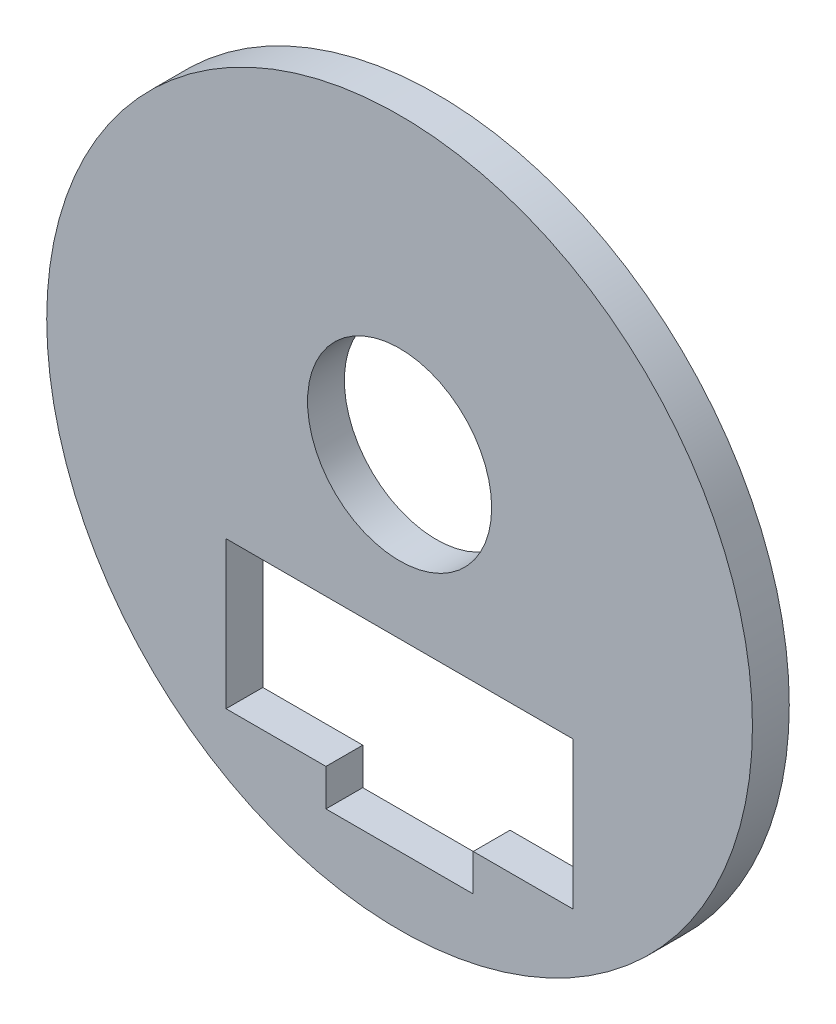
ISO-10303-21;
HEADER;
FILE_DESCRIPTION(('STEP AP214'),'2;1');
FILE_NAME('part.step','',(''),(''),'','','');
FILE_SCHEMA(('AUTOMOTIVE_DESIGN { 1 0 10303 214 1 1 1 1 }'));
ENDSEC;
DATA;
#1=APPLICATION_CONTEXT('core data for automotive mechanical design processes');
#2=APPLICATION_PROTOCOL_DEFINITION('international standard','automotive_design',2000,#1);
#3=PRODUCT_CONTEXT('',#1,'mechanical');
#4=PRODUCT('Part','Part','',(#3));
#5=PRODUCT_RELATED_PRODUCT_CATEGORY('part','',(#4));
#6=PRODUCT_DEFINITION_FORMATION('','',#4);
#7=PRODUCT_DEFINITION_CONTEXT('part definition',#1,'design');
#8=PRODUCT_DEFINITION('design','',#6,#7);
#9=PRODUCT_DEFINITION_SHAPE('','',#8);
#10=(LENGTH_UNIT() NAMED_UNIT(*) SI_UNIT(.MILLI.,.METRE.));
#11=(NAMED_UNIT(*) PLANE_ANGLE_UNIT() SI_UNIT($,.RADIAN.));
#12=(NAMED_UNIT(*) SI_UNIT($,.STERADIAN.) SOLID_ANGLE_UNIT());
#13=UNCERTAINTY_MEASURE_WITH_UNIT(LENGTH_MEASURE(1.E-05),#10,'distance_accuracy_value','');
#14=(GEOMETRIC_REPRESENTATION_CONTEXT(3) GLOBAL_UNCERTAINTY_ASSIGNED_CONTEXT((#13)) GLOBAL_UNIT_ASSIGNED_CONTEXT((#10,
#11,#12)) REPRESENTATION_CONTEXT('',''));
#15=CARTESIAN_POINT('',(0.,0.,0.));
#16=DIRECTION('',(0.,0.,1.));
#17=DIRECTION('',(1.,0.,0.));
#18=AXIS2_PLACEMENT_3D('',#15,#16,#17);
#19=CARTESIAN_POINT('',(-17.9578,-25.654,-3.81));
#20=DIRECTION('',(0.,-1.,0.));
#21=DIRECTION('',(0.,0.,-1.));
#22=AXIS2_PLACEMENT_3D('',#19,#20,#21);
#23=PLANE('',#22);
#24=DIRECTION('',(1.,0.,0.));
#25=VECTOR('',#24,1.);
#26=CARTESIAN_POINT('',(-17.9578,-25.654,0.));
#27=LINE('',#26,#25);
#28=CARTESIAN_POINT('',(-17.9578,-25.654,0.));
#29=VERTEX_POINT('',#28);
#30=CARTESIAN_POINT('',(-7.62,-25.654,0.));
#31=VERTEX_POINT('',#30);
#32=EDGE_CURVE('E116',#29,#31,#27,.T.);
#33=ORIENTED_EDGE('',*,*,#32,.T.);
#34=DIRECTION('',(0.,0.,-1.));
#35=VECTOR('',#34,1.);
#36=CARTESIAN_POINT('',(-7.62,-25.654,0.));
#37=LINE('',#36,#35);
#38=CARTESIAN_POINT('',(-7.62,-25.654,-3.81));
#39=VERTEX_POINT('',#38);
#40=EDGE_CURVE('E101',#31,#39,#37,.T.);
#41=ORIENTED_EDGE('',*,*,#40,.T.);
#42=DIRECTION('',(1.,0.,0.));
#43=VECTOR('',#42,1.);
#44=CARTESIAN_POINT('',(-17.9578,-25.654,-3.81));
#45=LINE('',#44,#43);
#46=CARTESIAN_POINT('',(-17.9578,-25.654,-3.81));
#47=VERTEX_POINT('',#46);
#48=EDGE_CURVE('E113',#47,#39,#45,.T.);
#49=ORIENTED_EDGE('',*,*,#48,.F.);
#50=DIRECTION('',(0.,0.,1.));
#51=VECTOR('',#50,1.);
#52=CARTESIAN_POINT('',(-17.9578,-25.654,-3.81));
#53=LINE('',#52,#51);
#54=EDGE_CURVE('E133',#47,#29,#53,.T.);
#55=ORIENTED_EDGE('',*,*,#54,.T.);
#56=EDGE_LOOP('',(#33,#41,#49,#55));
#57=FACE_BOUND('',#56,.T.);
#58=ADVANCED_FACE('F31',(#57),#23,.F.);
#59=CARTESIAN_POINT('',(0.,0.,-3.81));
#60=DIRECTION('',(0.,0.,1.));
#61=DIRECTION('',(1.,0.,0.));
#62=AXIS2_PLACEMENT_3D('',#59,#60,#61);
#63=CYLINDRICAL_SURFACE('',#62,36.5125);
#64=CARTESIAN_POINT('',(0.,0.,-3.81));
#65=DIRECTION('',(0.,0.,1.));
#66=DIRECTION('',(1.,0.,0.));
#67=AXIS2_PLACEMENT_3D('',#64,#65,#66);
#68=CIRCLE('',#67,36.5125);
#69=CARTESIAN_POINT('',(36.5125,0.,-3.81));
#70=VERTEX_POINT('',#69);
#71=EDGE_CURVE('E11',#70,#70,#68,.T.);
#72=CARTESIAN_POINT('',(0.,0.,0.));
#73=DIRECTION('',(0.,0.,1.));
#74=DIRECTION('',(1.,0.,0.));
#75=AXIS2_PLACEMENT_3D('',#72,#73,#74);
#76=CIRCLE('',#75,36.5125);
#77=CARTESIAN_POINT('',(36.5125,0.,0.));
#78=VERTEX_POINT('',#77);
#79=EDGE_CURVE('E39',#78,#78,#76,.T.);
#80=CARTESIAN_POINT('',(36.5125,0.,-3.81));
#81=CARTESIAN_POINT('',(36.5125,0.,-3.7703125));
#82=CARTESIAN_POINT('',(36.5125,0.,-3.730625));
#83=CARTESIAN_POINT('',(36.5125,0.,-3.65125));
#84=CARTESIAN_POINT('',(36.5125,0.,-3.6115625));
#85=CARTESIAN_POINT('',(36.5125,0.,-3.5321875));
#86=CARTESIAN_POINT('',(36.5125,0.,-3.4925));
#87=CARTESIAN_POINT('',(36.5125,0.,-3.413125));
#88=CARTESIAN_POINT('',(36.5125,0.,-3.3734375));
#89=CARTESIAN_POINT('',(36.5125,0.,-3.2940625));
#90=CARTESIAN_POINT('',(36.5125,0.,-3.254375));
#91=CARTESIAN_POINT('',(36.5125,0.,-3.175));
#92=CARTESIAN_POINT('',(36.5125,0.,-3.1353125));
#93=CARTESIAN_POINT('',(36.5125,0.,-3.0559375));
#94=CARTESIAN_POINT('',(36.5125,0.,-3.01625));
#95=CARTESIAN_POINT('',(36.5125,0.,-2.936875));
#96=CARTESIAN_POINT('',(36.5125,0.,-2.8971875));
#97=CARTESIAN_POINT('',(36.5125,0.,-2.8178125));
#98=CARTESIAN_POINT('',(36.5125,0.,-2.778125));
#99=CARTESIAN_POINT('',(36.5125,0.,-2.69875));
#100=CARTESIAN_POINT('',(36.5125,0.,-2.6590625));
#101=CARTESIAN_POINT('',(36.5125,0.,-2.5796875));
#102=CARTESIAN_POINT('',(36.5125,0.,-2.54));
#103=CARTESIAN_POINT('',(36.5125,0.,-2.460625));
#104=CARTESIAN_POINT('',(36.5125,0.,-2.4209375));
#105=CARTESIAN_POINT('',(36.5125,0.,-2.3415625));
#106=CARTESIAN_POINT('',(36.5125,0.,-2.301875));
#107=CARTESIAN_POINT('',(36.5125,0.,-2.2225));
#108=CARTESIAN_POINT('',(36.5125,0.,-2.1828125));
#109=CARTESIAN_POINT('',(36.5125,0.,-2.1034375));
#110=CARTESIAN_POINT('',(36.5125,0.,-2.06375));
#111=CARTESIAN_POINT('',(36.5125,0.,-1.984375));
#112=CARTESIAN_POINT('',(36.5125,0.,-1.9446875));
#113=CARTESIAN_POINT('',(36.5125,0.,-1.8653125));
#114=CARTESIAN_POINT('',(36.5125,0.,-1.825625));
#115=CARTESIAN_POINT('',(36.5125,0.,-1.74625));
#116=CARTESIAN_POINT('',(36.5125,0.,-1.7065625));
#117=CARTESIAN_POINT('',(36.5125,0.,-1.6271875));
#118=CARTESIAN_POINT('',(36.5125,0.,-1.5875));
#119=CARTESIAN_POINT('',(36.5125,0.,-1.508125));
#120=CARTESIAN_POINT('',(36.5125,0.,-1.4684375));
#121=CARTESIAN_POINT('',(36.5125,0.,-1.3890625));
#122=CARTESIAN_POINT('',(36.5125,0.,-1.349375));
#123=CARTESIAN_POINT('',(36.5125,0.,-1.27));
#124=CARTESIAN_POINT('',(36.5125,0.,-1.2303125));
#125=CARTESIAN_POINT('',(36.5125,0.,-1.1509375));
#126=CARTESIAN_POINT('',(36.5125,0.,-1.11125));
#127=CARTESIAN_POINT('',(36.5125,0.,-1.031875));
#128=CARTESIAN_POINT('',(36.5125,0.,-0.9921875));
#129=CARTESIAN_POINT('',(36.5125,0.,-0.9128125));
#130=CARTESIAN_POINT('',(36.5125,0.,-0.873125));
#131=CARTESIAN_POINT('',(36.5125,0.,-0.79375));
#132=CARTESIAN_POINT('',(36.5125,0.,-0.7540625));
#133=CARTESIAN_POINT('',(36.5125,0.,-0.6746875));
#134=CARTESIAN_POINT('',(36.5125,0.,-0.635));
#135=CARTESIAN_POINT('',(36.5125,0.,-0.555625));
#136=CARTESIAN_POINT('',(36.5125,0.,-0.5159375));
#137=CARTESIAN_POINT('',(36.5125,0.,-0.4365625));
#138=CARTESIAN_POINT('',(36.5125,0.,-0.396875));
#139=CARTESIAN_POINT('',(36.5125,0.,-0.3175));
#140=CARTESIAN_POINT('',(36.5125,0.,-0.2778125));
#141=CARTESIAN_POINT('',(36.5125,0.,-0.1984375));
#142=CARTESIAN_POINT('',(36.5125,0.,-0.15875));
#143=CARTESIAN_POINT('',(36.5125,0.,-0.0793749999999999));
#144=CARTESIAN_POINT('',(36.5125,0.,-0.0396874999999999));
#145=CARTESIAN_POINT('',(36.5125,0.,0.));
#146=B_SPLINE_CURVE_WITH_KNOTS('',3,(#80,#81,#82,#83,#84,#85,#86,#87,#88,#89,#90,#91,#92,#93,
#94,#95,#96,#97,#98,#99,#100,#101,#102,#103,#104,#105,#106,#107,#108,#109,#110,#111,#112,#113,
#114,#115,#116,#117,#118,#119,#120,#121,#122,#123,#124,#125,#126,#127,#128,#129,#130,#131,#132,
#133,#134,#135,#136,#137,#138,#139,#140,#141,#142,#143,#144,#145),.UNSPECIFIED.,.F.,.F.,(4,2,2,
2,2,2,2,2,2,2,2,2,2,2,2,2,2,2,2,2,2,2,2,2,2,2,2,2,2,2,2,2,4),(0.,0.1190625,0.238125,0.3571875,
0.47625,0.5953125,0.714375,0.8334375,0.9525,1.0715625,1.190625,1.3096875,1.42875,1.5478125,
1.666875,1.7859375,1.905,2.0240625,2.143125,2.2621875,2.38125,2.5003125,2.619375,2.7384375,
2.8575,2.9765625,3.095625,3.2146875,3.33375,3.4528125,3.571875,3.6909375,3.81),.UNSPECIFIED.);
#147=EDGE_CURVE('BSEAM33',#70,#78,#146,.T.);
#148=ORIENTED_EDGE('',*,*,#71,.T.);
#149=ORIENTED_EDGE('',*,*,#79,.F.);
#150=ORIENTED_EDGE('',*,*,#147,.T.);
#151=ORIENTED_EDGE('',*,*,#147,.F.);
#152=EDGE_LOOP('',(#148,#150,#149,#151));
#153=FACE_BOUND('',#152,.T.);
#154=ADVANCED_FACE('F33',(#153),#63,.T.);
#155=CARTESIAN_POINT('',(0.,0.,-3.81));
#156=DIRECTION('',(0.,0.,1.));
#157=DIRECTION('',(1.,0.,0.));
#158=AXIS2_PLACEMENT_3D('',#155,#156,#157);
#159=PLANE('',#158);
#160=ORIENTED_EDGE('',*,*,#48,.T.);
#161=DIRECTION('',(0.,1.,0.));
#162=VECTOR('',#161,1.);
#163=CARTESIAN_POINT('',(-7.62,-29.464,-3.81));
#164=LINE('',#163,#162);
#165=CARTESIAN_POINT('',(-7.62,-29.464,-3.81));
#166=VERTEX_POINT('',#165);
#167=EDGE_CURVE('E97',#166,#39,#164,.T.);
#168=ORIENTED_EDGE('',*,*,#167,.F.);
#169=DIRECTION('',(-1.,0.,0.));
#170=VECTOR('',#169,1.);
#171=CARTESIAN_POINT('',(-7.62,-29.464,-3.81));
#172=LINE('',#171,#170);
#173=CARTESIAN_POINT('',(7.62,-29.464,-3.81));
#174=VERTEX_POINT('',#173);
#175=EDGE_CURVE('E203',#174,#166,#172,.T.);
#176=ORIENTED_EDGE('',*,*,#175,.F.);
#177=DIRECTION('',(0.,-1.,0.));
#178=VECTOR('',#177,1.);
#179=CARTESIAN_POINT('',(7.62,-29.464,-3.81));
#180=LINE('',#179,#178);
#181=CARTESIAN_POINT('',(7.62,-25.654,-3.81));
#182=VERTEX_POINT('',#181);
#183=EDGE_CURVE('E107',#182,#174,#180,.T.);
#184=ORIENTED_EDGE('',*,*,#183,.F.);
#185=CARTESIAN_POINT('',(17.9578,-25.654,-3.81));
#186=VERTEX_POINT('',#185);
#187=EDGE_CURVE('E54',#182,#186,#45,.T.);
#188=ORIENTED_EDGE('',*,*,#187,.T.);
#189=DIRECTION('',(0.,1.,0.));
#190=VECTOR('',#189,1.);
#191=CARTESIAN_POINT('',(17.9578,-25.654,-3.81));
#192=LINE('',#191,#190);
#193=CARTESIAN_POINT('',(17.9578,-10.414,-3.81));
#194=VERTEX_POINT('',#193);
#195=EDGE_CURVE('E125',#186,#194,#192,.T.);
#196=ORIENTED_EDGE('',*,*,#195,.T.);
#197=DIRECTION('',(-1.,0.,0.));
#198=VECTOR('',#197,1.);
#199=CARTESIAN_POINT('',(-17.9578,-10.414,-3.81));
#200=LINE('',#199,#198);
#201=CARTESIAN_POINT('',(-17.9578,-10.414,-3.81));
#202=VERTEX_POINT('',#201);
#203=EDGE_CURVE('E127',#194,#202,#200,.T.);
#204=ORIENTED_EDGE('',*,*,#203,.T.);
#205=DIRECTION('',(0.,-1.,0.));
#206=VECTOR('',#205,1.);
#207=CARTESIAN_POINT('',(-17.9578,-10.414,-3.81));
#208=LINE('',#207,#206);
#209=EDGE_CURVE('E124',#202,#47,#208,.T.);
#210=ORIENTED_EDGE('',*,*,#209,.T.);
#211=EDGE_LOOP('',(#160,#168,#176,#184,#188,#196,#204,#210));
#212=FACE_BOUND('',#211,.T.);
#213=CARTESIAN_POINT('',(0.,6.096,-3.81));
#214=DIRECTION('',(0.,0.,1.));
#215=DIRECTION('',(1.,0.,0.));
#216=AXIS2_PLACEMENT_3D('',#213,#214,#215);
#217=CIRCLE('',#216,9.525);
#218=CARTESIAN_POINT('',(9.525,6.096,-3.81));
#219=VERTEX_POINT('',#218);
#220=EDGE_CURVE('E145',#219,#219,#217,.T.);
#221=ORIENTED_EDGE('',*,*,#220,.T.);
#222=EDGE_LOOP('',(#221));
#223=FACE_BOUND('',#222,.T.);
#224=ORIENTED_EDGE('',*,*,#71,.F.);
#225=EDGE_LOOP('',(#224));
#226=FACE_BOUND('',#225,.T.);
#227=ADVANCED_FACE('F120',(#212,#223,#226),#159,.F.);
#228=CARTESIAN_POINT('',(0.,0.,0.));
#229=DIRECTION('',(0.,0.,1.));
#230=DIRECTION('',(1.,0.,0.));
#231=AXIS2_PLACEMENT_3D('',#228,#229,#230);
#232=PLANE('',#231);
#233=DIRECTION('',(0.,1.,0.));
#234=VECTOR('',#233,1.);
#235=CARTESIAN_POINT('',(-7.62,-29.464,0.));
#236=LINE('',#235,#234);
#237=CARTESIAN_POINT('',(-7.62,-29.464,0.));
#238=VERTEX_POINT('',#237);
#239=EDGE_CURVE('E201',#238,#31,#236,.T.);
#240=ORIENTED_EDGE('',*,*,#239,.T.);
#241=ORIENTED_EDGE('',*,*,#32,.F.);
#242=DIRECTION('',(0.,-1.,0.));
#243=VECTOR('',#242,1.);
#244=CARTESIAN_POINT('',(-17.9578,-10.414,0.));
#245=LINE('',#244,#243);
#246=CARTESIAN_POINT('',(-17.9578,-10.414,0.));
#247=VERTEX_POINT('',#246);
#248=EDGE_CURVE('E192',#247,#29,#245,.T.);
#249=ORIENTED_EDGE('',*,*,#248,.F.);
#250=DIRECTION('',(-1.,0.,0.));
#251=VECTOR('',#250,1.);
#252=CARTESIAN_POINT('',(-17.9578,-10.414,0.));
#253=LINE('',#252,#251);
#254=CARTESIAN_POINT('',(17.9578,-10.414,0.));
#255=VERTEX_POINT('',#254);
#256=EDGE_CURVE('E188',#255,#247,#253,.T.);
#257=ORIENTED_EDGE('',*,*,#256,.F.);
#258=DIRECTION('',(0.,1.,0.));
#259=VECTOR('',#258,1.);
#260=CARTESIAN_POINT('',(17.9578,-25.654,0.));
#261=LINE('',#260,#259);
#262=CARTESIAN_POINT('',(17.9578,-25.654,0.));
#263=VERTEX_POINT('',#262);
#264=EDGE_CURVE('E182',#263,#255,#261,.T.);
#265=ORIENTED_EDGE('',*,*,#264,.F.);
#266=CARTESIAN_POINT('',(7.61999999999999,-25.654,0.));
#267=VERTEX_POINT('',#266);
#268=EDGE_CURVE('E179',#267,#263,#27,.T.);
#269=ORIENTED_EDGE('',*,*,#268,.F.);
#270=DIRECTION('',(0.,-1.,0.));
#271=VECTOR('',#270,1.);
#272=CARTESIAN_POINT('',(7.62,-29.464,0.));
#273=LINE('',#272,#271);
#274=CARTESIAN_POINT('',(7.62,-29.464,0.));
#275=VERTEX_POINT('',#274);
#276=EDGE_CURVE('E46',#267,#275,#273,.T.);
#277=ORIENTED_EDGE('',*,*,#276,.T.);
#278=DIRECTION('',(-1.,0.,0.));
#279=VECTOR('',#278,1.);
#280=CARTESIAN_POINT('',(-7.62,-29.464,0.));
#281=LINE('',#280,#279);
#282=EDGE_CURVE('E118',#275,#238,#281,.T.);
#283=ORIENTED_EDGE('',*,*,#282,.T.);
#284=EDGE_LOOP('',(#240,#241,#249,#257,#265,#269,#277,#283));
#285=FACE_BOUND('',#284,.T.);
#286=CARTESIAN_POINT('',(0.,6.096,0.));
#287=DIRECTION('',(0.,0.,1.));
#288=DIRECTION('',(1.,0.,0.));
#289=AXIS2_PLACEMENT_3D('',#286,#287,#288);
#290=CIRCLE('',#289,9.525);
#291=CARTESIAN_POINT('',(9.525,6.096,0.));
#292=VERTEX_POINT('',#291);
#293=EDGE_CURVE('E136',#292,#292,#290,.T.);
#294=ORIENTED_EDGE('',*,*,#293,.F.);
#295=EDGE_LOOP('',(#294));
#296=FACE_BOUND('',#295,.T.);
#297=ORIENTED_EDGE('',*,*,#79,.T.);
#298=EDGE_LOOP('',(#297));
#299=FACE_BOUND('',#298,.T.);
#300=ADVANCED_FACE('F150',(#285,#296,#299),#232,.T.);
#301=CARTESIAN_POINT('',(0.,6.096,-3.81));
#302=DIRECTION('',(0.,0.,1.));
#303=DIRECTION('',(1.,0.,0.));
#304=AXIS2_PLACEMENT_3D('',#301,#302,#303);
#305=CYLINDRICAL_SURFACE('',#304,9.525);
#306=CARTESIAN_POINT('',(9.525,6.096,-3.81));
#307=CARTESIAN_POINT('',(9.525,6.096,-3.7703125));
#308=CARTESIAN_POINT('',(9.525,6.096,-3.730625));
#309=CARTESIAN_POINT('',(9.525,6.096,-3.65125));
#310=CARTESIAN_POINT('',(9.525,6.096,-3.6115625));
#311=CARTESIAN_POINT('',(9.525,6.096,-3.5321875));
#312=CARTESIAN_POINT('',(9.525,6.096,-3.4925));
#313=CARTESIAN_POINT('',(9.525,6.096,-3.413125));
#314=CARTESIAN_POINT('',(9.525,6.096,-3.3734375));
#315=CARTESIAN_POINT('',(9.525,6.096,-3.2940625));
#316=CARTESIAN_POINT('',(9.525,6.096,-3.254375));
#317=CARTESIAN_POINT('',(9.525,6.096,-3.175));
#318=CARTESIAN_POINT('',(9.525,6.096,-3.1353125));
#319=CARTESIAN_POINT('',(9.525,6.096,-3.0559375));
#320=CARTESIAN_POINT('',(9.525,6.096,-3.01625));
#321=CARTESIAN_POINT('',(9.525,6.096,-2.936875));
#322=CARTESIAN_POINT('',(9.525,6.096,-2.8971875));
#323=CARTESIAN_POINT('',(9.525,6.096,-2.8178125));
#324=CARTESIAN_POINT('',(9.525,6.096,-2.778125));
#325=CARTESIAN_POINT('',(9.525,6.096,-2.69875));
#326=CARTESIAN_POINT('',(9.525,6.096,-2.6590625));
#327=CARTESIAN_POINT('',(9.525,6.096,-2.5796875));
#328=CARTESIAN_POINT('',(9.525,6.096,-2.54));
#329=CARTESIAN_POINT('',(9.525,6.096,-2.460625));
#330=CARTESIAN_POINT('',(9.525,6.096,-2.4209375));
#331=CARTESIAN_POINT('',(9.525,6.096,-2.3415625));
#332=CARTESIAN_POINT('',(9.525,6.096,-2.301875));
#333=CARTESIAN_POINT('',(9.525,6.096,-2.2225));
#334=CARTESIAN_POINT('',(9.525,6.096,-2.1828125));
#335=CARTESIAN_POINT('',(9.525,6.096,-2.1034375));
#336=CARTESIAN_POINT('',(9.525,6.096,-2.06375));
#337=CARTESIAN_POINT('',(9.525,6.096,-1.984375));
#338=CARTESIAN_POINT('',(9.525,6.096,-1.9446875));
#339=CARTESIAN_POINT('',(9.525,6.096,-1.8653125));
#340=CARTESIAN_POINT('',(9.525,6.096,-1.825625));
#341=CARTESIAN_POINT('',(9.525,6.096,-1.74625));
#342=CARTESIAN_POINT('',(9.525,6.096,-1.7065625));
#343=CARTESIAN_POINT('',(9.525,6.096,-1.6271875));
#344=CARTESIAN_POINT('',(9.525,6.096,-1.5875));
#345=CARTESIAN_POINT('',(9.525,6.096,-1.508125));
#346=CARTESIAN_POINT('',(9.525,6.096,-1.4684375));
#347=CARTESIAN_POINT('',(9.525,6.096,-1.3890625));
#348=CARTESIAN_POINT('',(9.525,6.096,-1.349375));
#349=CARTESIAN_POINT('',(9.525,6.096,-1.27));
#350=CARTESIAN_POINT('',(9.525,6.096,-1.2303125));
#351=CARTESIAN_POINT('',(9.525,6.096,-1.1509375));
#352=CARTESIAN_POINT('',(9.525,6.096,-1.11125));
#353=CARTESIAN_POINT('',(9.525,6.096,-1.031875));
#354=CARTESIAN_POINT('',(9.525,6.096,-0.9921875));
#355=CARTESIAN_POINT('',(9.525,6.096,-0.9128125));
#356=CARTESIAN_POINT('',(9.525,6.096,-0.873125));
#357=CARTESIAN_POINT('',(9.525,6.096,-0.79375));
#358=CARTESIAN_POINT('',(9.525,6.096,-0.7540625));
#359=CARTESIAN_POINT('',(9.525,6.096,-0.6746875));
#360=CARTESIAN_POINT('',(9.525,6.096,-0.635));
#361=CARTESIAN_POINT('',(9.525,6.096,-0.555625));
#362=CARTESIAN_POINT('',(9.525,6.096,-0.5159375));
#363=CARTESIAN_POINT('',(9.525,6.096,-0.4365625));
#364=CARTESIAN_POINT('',(9.525,6.096,-0.396875));
#365=CARTESIAN_POINT('',(9.525,6.096,-0.3175));
#366=CARTESIAN_POINT('',(9.525,6.096,-0.2778125));
#367=CARTESIAN_POINT('',(9.525,6.096,-0.1984375));
#368=CARTESIAN_POINT('',(9.525,6.096,-0.15875));
#369=CARTESIAN_POINT('',(9.525,6.096,-0.0793749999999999));
#370=CARTESIAN_POINT('',(9.525,6.096,-0.0396874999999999));
#371=CARTESIAN_POINT('',(9.525,6.096,0.));
#372=B_SPLINE_CURVE_WITH_KNOTS('',3,(#306,#307,#308,#309,#310,#311,#312,#313,#314,#315,#316,
#317,#318,#319,#320,#321,#322,#323,#324,#325,#326,#327,#328,#329,#330,#331,#332,#333,#334,#335,
#336,#337,#338,#339,#340,#341,#342,#343,#344,#345,#346,#347,#348,#349,#350,#351,#352,#353,#354,
#355,#356,#357,#358,#359,#360,#361,#362,#363,#364,#365,#366,#367,#368,#369,#370,#371),
.UNSPECIFIED.,.F.,.F.,(4,2,2,2,2,2,2,2,2,2,2,2,2,2,2,2,2,2,2,2,2,2,2,2,2,2,2,2,2,2,2,2,4),(0.,
0.1190625,0.238125,0.3571875,0.47625,0.5953125,0.714375,0.833437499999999,0.9525,1.0715625,
1.190625,1.3096875,1.42875,1.5478125,1.666875,1.7859375,1.905,2.0240625,2.143125,2.2621875,
2.38125,2.5003125,2.619375,2.7384375,2.8575,2.9765625,3.095625,3.2146875,3.33375,3.4528125,
3.571875,3.6909375,3.81),.UNSPECIFIED.);
#373=EDGE_CURVE('BSEAM218',#219,#292,#372,.T.);
#374=ORIENTED_EDGE('',*,*,#220,.F.);
#375=ORIENTED_EDGE('',*,*,#293,.T.);
#376=ORIENTED_EDGE('',*,*,#373,.T.);
#377=ORIENTED_EDGE('',*,*,#373,.F.);
#378=EDGE_LOOP('',(#374,#376,#375,#377));
#379=FACE_BOUND('',#378,.T.);
#380=ADVANCED_FACE('F218',(#379),#305,.F.);
#381=CARTESIAN_POINT('',(-17.9578,-10.414,-3.81));
#382=DIRECTION('',(-1.,0.,0.));
#383=DIRECTION('',(0.,0.,1.));
#384=AXIS2_PLACEMENT_3D('',#381,#382,#383);
#385=PLANE('',#384);
#386=ORIENTED_EDGE('',*,*,#248,.T.);
#387=ORIENTED_EDGE('',*,*,#54,.F.);
#388=ORIENTED_EDGE('',*,*,#209,.F.);
#389=DIRECTION('',(0.,0.,1.));
#390=VECTOR('',#389,1.);
#391=CARTESIAN_POINT('',(-17.9578,-10.414,-3.81));
#392=LINE('',#391,#390);
#393=EDGE_CURVE('E134',#202,#247,#392,.T.);
#394=ORIENTED_EDGE('',*,*,#393,.T.);
#395=EDGE_LOOP('',(#386,#387,#388,#394));
#396=FACE_BOUND('',#395,.T.);
#397=ADVANCED_FACE('F210',(#396),#385,.F.);
#398=CARTESIAN_POINT('',(-17.9578,-10.414,-3.81));
#399=DIRECTION('',(0.,1.,0.));
#400=DIRECTION('',(0.,0.,1.));
#401=AXIS2_PLACEMENT_3D('',#398,#399,#400);
#402=PLANE('',#401);
#403=ORIENTED_EDGE('',*,*,#256,.T.);
#404=ORIENTED_EDGE('',*,*,#393,.F.);
#405=ORIENTED_EDGE('',*,*,#203,.F.);
#406=DIRECTION('',(0.,0.,1.));
#407=VECTOR('',#406,1.);
#408=CARTESIAN_POINT('',(17.9578,-10.414,-3.81));
#409=LINE('',#408,#407);
#410=EDGE_CURVE('E137',#194,#255,#409,.T.);
#411=ORIENTED_EDGE('',*,*,#410,.T.);
#412=EDGE_LOOP('',(#403,#404,#405,#411));
#413=FACE_BOUND('',#412,.T.);
#414=ADVANCED_FACE('F175',(#413),#402,.F.);
#415=CARTESIAN_POINT('',(17.9578,-25.654,-3.81));
#416=DIRECTION('',(1.,0.,0.));
#417=DIRECTION('',(0.,0.,-1.));
#418=AXIS2_PLACEMENT_3D('',#415,#416,#417);
#419=PLANE('',#418);
#420=ORIENTED_EDGE('',*,*,#264,.T.);
#421=ORIENTED_EDGE('',*,*,#410,.F.);
#422=ORIENTED_EDGE('',*,*,#195,.F.);
#423=DIRECTION('',(0.,0.,1.));
#424=VECTOR('',#423,1.);
#425=CARTESIAN_POINT('',(17.9578,-25.654,-3.81));
#426=LINE('',#425,#424);
#427=EDGE_CURVE('E139',#186,#263,#426,.T.);
#428=ORIENTED_EDGE('',*,*,#427,.T.);
#429=EDGE_LOOP('',(#420,#421,#422,#428));
#430=FACE_BOUND('',#429,.T.);
#431=ADVANCED_FACE('F167',(#430),#419,.F.);
#432=ORIENTED_EDGE('',*,*,#187,.F.);
#433=DIRECTION('',(0.,0.,-1.));
#434=VECTOR('',#433,1.);
#435=CARTESIAN_POINT('',(7.62,-25.654,0.));
#436=LINE('',#435,#434);
#437=EDGE_CURVE('E117',#267,#182,#436,.T.);
#438=ORIENTED_EDGE('',*,*,#437,.F.);
#439=ORIENTED_EDGE('',*,*,#268,.T.);
#440=ORIENTED_EDGE('',*,*,#427,.F.);
#441=EDGE_LOOP('',(#432,#438,#439,#440));
#442=FACE_BOUND('',#441,.T.);
#443=ADVANCED_FACE('F159',(#442),#23,.F.);
#444=CARTESIAN_POINT('',(-7.62,-29.464,0.));
#445=DIRECTION('',(-1.,0.,0.));
#446=DIRECTION('',(0.,0.,1.));
#447=AXIS2_PLACEMENT_3D('',#444,#445,#446);
#448=PLANE('',#447);
#449=ORIENTED_EDGE('',*,*,#167,.T.);
#450=ORIENTED_EDGE('',*,*,#40,.F.);
#451=ORIENTED_EDGE('',*,*,#239,.F.);
#452=DIRECTION('',(0.,0.,-1.));
#453=VECTOR('',#452,1.);
#454=CARTESIAN_POINT('',(-7.62,-29.464,0.));
#455=LINE('',#454,#453);
#456=EDGE_CURVE('E103',#238,#166,#455,.T.);
#457=ORIENTED_EDGE('',*,*,#456,.T.);
#458=EDGE_LOOP('',(#449,#450,#451,#457));
#459=FACE_BOUND('',#458,.T.);
#460=ADVANCED_FACE('F99',(#459),#448,.F.);
#461=CARTESIAN_POINT('',(-7.62,-29.464,0.));
#462=DIRECTION('',(0.,-1.,0.));
#463=DIRECTION('',(1.,0.,0.));
#464=AXIS2_PLACEMENT_3D('',#461,#462,#463);
#465=PLANE('',#464);
#466=ORIENTED_EDGE('',*,*,#175,.T.);
#467=ORIENTED_EDGE('',*,*,#456,.F.);
#468=ORIENTED_EDGE('',*,*,#282,.F.);
#469=DIRECTION('',(0.,0.,-1.));
#470=VECTOR('',#469,1.);
#471=CARTESIAN_POINT('',(7.62,-29.464,0.));
#472=LINE('',#471,#470);
#473=EDGE_CURVE('E195',#275,#174,#472,.T.);
#474=ORIENTED_EDGE('',*,*,#473,.T.);
#475=EDGE_LOOP('',(#466,#467,#468,#474));
#476=FACE_BOUND('',#475,.T.);
#477=ADVANCED_FACE('F173',(#476),#465,.F.);
#478=CARTESIAN_POINT('',(7.62,-29.464,0.));
#479=DIRECTION('',(1.,0.,0.));
#480=DIRECTION('',(0.,0.,-1.));
#481=AXIS2_PLACEMENT_3D('',#478,#479,#480);
#482=PLANE('',#481);
#483=ORIENTED_EDGE('',*,*,#183,.T.);
#484=ORIENTED_EDGE('',*,*,#473,.F.);
#485=ORIENTED_EDGE('',*,*,#276,.F.);
#486=ORIENTED_EDGE('',*,*,#437,.T.);
#487=EDGE_LOOP('',(#483,#484,#485,#486));
#488=FACE_BOUND('',#487,.T.);
#489=ADVANCED_FACE('F206',(#488),#482,.F.);
#490=CLOSED_SHELL('',(#58,#154,#227,#300,#380,#397,#414,#431,#443,#460,#477,#489));
#491=MANIFOLD_SOLID_BREP('B2',#490);
#492=ADVANCED_BREP_SHAPE_REPRESENTATION('',(#18,#491),#14);
#493=SHAPE_DEFINITION_REPRESENTATION(#9,#492);
ENDSEC;
END-ISO-10303-21;
